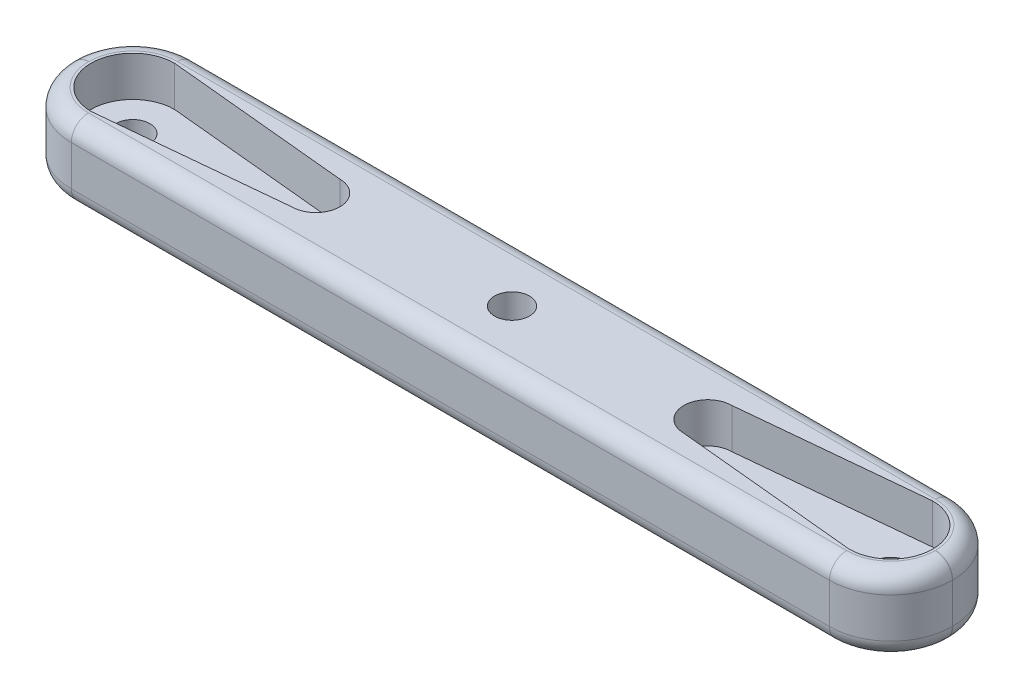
from build123d import *

# Parameters (mm, degrees)
SKETCH1_W           = 77
SKETCH1_H           = 10.77
BOSS_EXTRUDE1_DEPTH = 6.5
SKETCH2_R           = 1.5
CUT_EXTRUDE1_DEPTH  = 3.5
SKETCH4_R           = 1.5
CUT_EXTRUDE4_DEPTH  = 40.414441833
CUT_EXTRUDE5_DEPTH  = 3.5
CUT_EXTRUDE6_DEPTH  = 40.414441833
SKETCH5_R           = 1.525
CUT_EXTRUDE7_DEPTH  = 40.414441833
FILLET1_R           = 1.5


with BuildPart() as part:
    # Sketch1 → Boss-Extrude1 (new body)
    with BuildSketch(Plane(origin=(0, 0, 0), x_dir=(1, 0, 0), z_dir=(0, 1, 0))):
        Rectangle(SKETCH1_W, SKETCH1_H)
    extrude(amount=BOSS_EXTRUDE1_DEPTH)

    # Sketch2 → Cut-Extrude1 (cut)
    # profile 1 of 2: a face of its own
    with BuildSketch(Plane(origin=(0, 6.5, 0), x_dir=(1, 0, 0), z_dir=(0, 1, 0))):
        with BuildLine():
            ThreePointArc((-32.429387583, -3.597128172), (-30.312222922, -2.335050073), (-29.48, -0.015))
            ThreePointArc((-29.48, -0.015), (-30.312222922, 2.305050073), (-32.429387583, 3.567128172))
            Line((-32.429387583, 3.567128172), (-33.13, 3.635))
            ThreePointArc((-33.13, 3.635), (-36.78, -0.015), (-33.13, -3.665))
            Line((-33.13, -3.665), (-32.429387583, -3.597128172))
        make_face()
        with Locations(Location((-33.13, -0.015, 0), (0, 0, 270))):
            Circle(SKETCH2_R, mode=Mode.SUBTRACT)
    # profile 2 of 2: a face of its own
    with BuildSketch(Plane(origin=(0, 6.5, 0), x_dir=(1, 0, 0), z_dir=(0, 1, 0))):
        with BuildLine():
            ThreePointArc((32.429387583, 3.567128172), (30.312222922, 2.305050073), (29.48, -0.015))
            ThreePointArc((29.48, -0.015), (30.312222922, -2.335050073), (32.429387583, -3.597128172))
            Line((32.429387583, -3.597128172), (33.13, -3.665))
            ThreePointArc((33.13, -3.665), (36.78, -0.015), (33.13, 3.635))
            Line((33.13, 3.635), (32.429387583, 3.567128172))
        make_face()
        with Locations(Location((33.13, -0.015, 0), (0, 0, 270))):
            Circle(SKETCH2_R, mode=Mode.SUBTRACT)
    extrude(amount=-CUT_EXTRUDE1_DEPTH, mode=Mode.SUBTRACT)

    # Sketch4 → Cut-Extrude4 (cut, through all)
    with BuildSketch(Plane(origin=(0, 6.5, 0), x_dir=(1, 0, 0), z_dir=(0, 1, 0))):
        with Locations(Location((-33.13, -0.015, 0), (0, 0, 270))):
            Circle(SKETCH4_R)
        with Locations(Location((33.13, -0.015, 0), (0, 0, 270))):
            Circle(SKETCH4_R)
    extrude(amount=-CUT_EXTRUDE4_DEPTH, mode=Mode.SUBTRACT)

    # Sketch2_5 → Cut-Extrude5 (cut)
    with BuildSketch(Plane(origin=(0, 6.5, 0), x_dir=(1, 0, 0), z_dir=(0, 1, 0))):
        with BuildLine():
            ThreePointArc((-32.429387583, 3.567128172), (-29.48, -0.015), (-32.429387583, -3.597128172))
            Line((-32.429387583, -3.597128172), (-17.13, -2.115))
            ThreePointArc((-17.13, -2.115), (-15.03, -0.015), (-17.13, 2.085))
            Line((-17.13, 2.085), (-32.429387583, 3.567128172))
        make_face()
        with BuildLine():
            ThreePointArc((32.429387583, -3.597128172), (29.48, -0.015), (32.429387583, 3.567128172))
            Line((32.429387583, 3.567128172), (17.13, 2.085))
            ThreePointArc((17.13, 2.085), (15.03, -0.015), (17.13, -2.115))
            Line((17.13, -2.115), (32.429387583, -3.597128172))
        make_face()
    extrude(amount=-CUT_EXTRUDE5_DEPTH, mode=Mode.SUBTRACT)

    # Sketch2_6 → Cut-Extrude6 (cut, through all)
    with BuildSketch(Plane(origin=(0, 6.5, 0), x_dir=(1, 0, 0), z_dir=(0, 1, 0))):
        with BuildLine():
            Line((-38.5, 5.385), (-38.5, 0.015))
            ThreePointArc((-38.5, 0.015), (-36.927163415, 3.812163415), (-33.13, 5.385))
            Line((-33.13, 5.385), (-38.5, 5.385))
        make_face()
        with BuildLine():
            Line((-38.5, -5.385), (-33.13, -5.385))
            ThreePointArc((-33.13, -5.385), (-36.927163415, -3.812163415), (-38.5, -0.015))
            Line((-38.5, -0.015), (-38.5, -5.385))
        make_face()
        with BuildLine():
            ThreePointArc((38.5, -0.015), (36.927163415, -3.812163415), (33.13, -5.385))
            Line((33.13, -5.385), (38.5, -5.385))
            Line((38.5, -5.385), (38.5, -0.015))
        make_face()
        with BuildLine():
            ThreePointArc((33.13, 5.385), (36.927163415, 3.812163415), (38.5, 0.015))
            Line((38.5, 0.015), (38.5, 5.385))
            Line((38.5, 5.385), (33.13, 5.385))
        make_face()
    extrude(amount=-CUT_EXTRUDE6_DEPTH, mode=Mode.SUBTRACT)

    # Sketch5 → Cut-Extrude7 (cut, through all)
    with BuildSketch(Plane(origin=(0, 6.5, 0), x_dir=(1, 0, 0), z_dir=(0, 1, 0))):
        with Locations(Location((0, 0, 0), (0, 0, 270))):
            Circle(SKETCH5_R)
    extrude(amount=-CUT_EXTRUDE7_DEPTH, mode=Mode.SUBTRACT)

    # Fillet1
    fillet1_edges = [part.edges().sort_by_distance(p)[0] for p in [
        (-36.927163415, 6.5, 3.812163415),
        (-36.927163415, 0, 3.812163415),
        (-36.927163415, 6.5, -3.812163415),
        (-36.927163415, 0, -3.812163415),
        (38.5, 0, 0),
        (0, 0, 5.385),
        (-38.5, 0, 0),
        (0, 0, -5.385),
        (0, 6.5, 5.385),
        (-38.5, 6.5, 0),
        (0, 6.5, -5.385),
        (38.5, 6.5, 0),
        (36.927163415, 6.5, -3.812163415),
        (36.927163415, 0, -3.812163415),
        (36.927163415, 0, 3.812163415),
        (36.927163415, 6.5, 3.812163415),
    ]]
    fillet(fillet1_edges, radius=FILLET1_R)


solid = part.part
